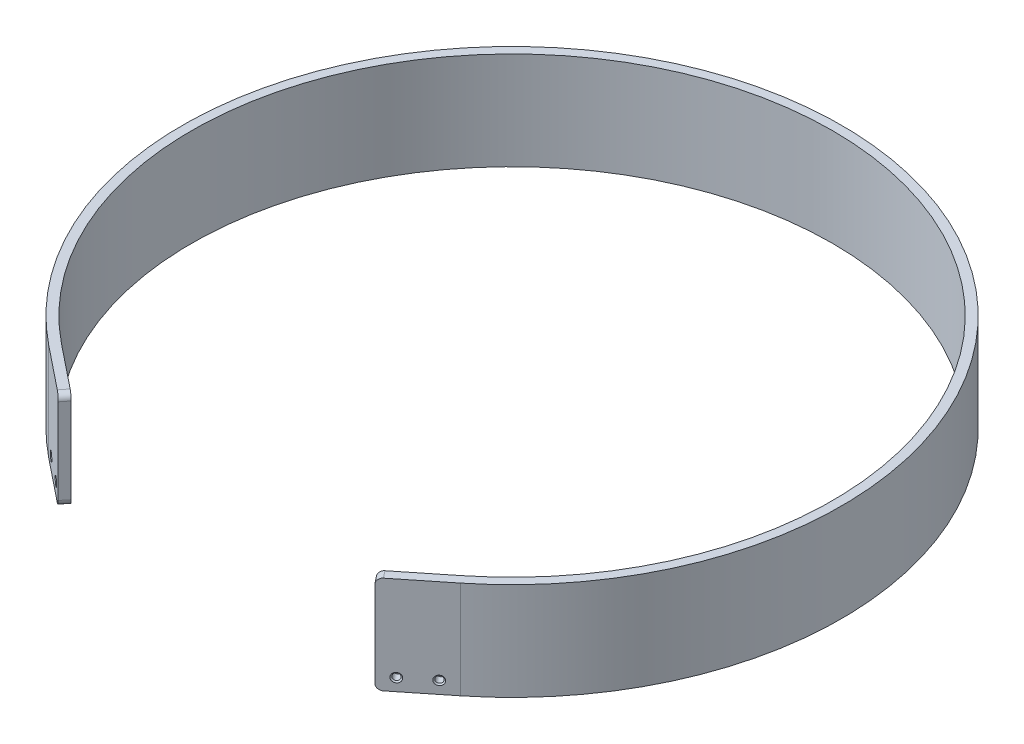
ISO-10303-21;
HEADER;
FILE_DESCRIPTION(('STEP AP214'),'2;1');
FILE_NAME('part.step','',(''),(''),'','','');
FILE_SCHEMA(('AUTOMOTIVE_DESIGN { 1 0 10303 214 1 1 1 1 }'));
ENDSEC;
DATA;
#1=APPLICATION_CONTEXT('core data for automotive mechanical design processes');
#2=APPLICATION_PROTOCOL_DEFINITION('international standard','automotive_design',2000,#1);
#3=PRODUCT_CONTEXT('',#1,'mechanical');
#4=PRODUCT('Part','Part','',(#3));
#5=PRODUCT_RELATED_PRODUCT_CATEGORY('part','',(#4));
#6=PRODUCT_DEFINITION_FORMATION('','',#4);
#7=PRODUCT_DEFINITION_CONTEXT('part definition',#1,'design');
#8=PRODUCT_DEFINITION('design','',#6,#7);
#9=PRODUCT_DEFINITION_SHAPE('','',#8);
#10=(LENGTH_UNIT() NAMED_UNIT(*) SI_UNIT(.MILLI.,.METRE.));
#11=(NAMED_UNIT(*) PLANE_ANGLE_UNIT() SI_UNIT($,.RADIAN.));
#12=(NAMED_UNIT(*) SI_UNIT($,.STERADIAN.) SOLID_ANGLE_UNIT());
#13=UNCERTAINTY_MEASURE_WITH_UNIT(LENGTH_MEASURE(1.E-05),#10,'distance_accuracy_value','');
#14=(GEOMETRIC_REPRESENTATION_CONTEXT(3) GLOBAL_UNCERTAINTY_ASSIGNED_CONTEXT((#13)) GLOBAL_UNIT_ASSIGNED_CONTEXT((#10,
#11,#12)) REPRESENTATION_CONTEXT('',''));
#15=CARTESIAN_POINT('',(0.,0.,0.));
#16=DIRECTION('',(0.,0.,1.));
#17=DIRECTION('',(1.,0.,0.));
#18=AXIS2_PLACEMENT_3D('',#15,#16,#17);
#19=CARTESIAN_POINT('',(104.16246233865,25.4,130.134177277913));
#20=DIRECTION('',(0.624896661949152,0.,0.780707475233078));
#21=DIRECTION('',(0.780707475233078,0.,-0.624896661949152));
#22=AXIS2_PLACEMENT_3D('',#19,#20,#21);
#23=PLANE('',#22);
#24=CARTESIAN_POINT('',(85.5718655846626,-19.05,145.014529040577));
#25=DIRECTION('',(0.624896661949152,0.,0.780707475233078));
#26=DIRECTION('',(0.780707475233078,0.,-0.624896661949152));
#27=AXIS2_PLACEMENT_3D('',#24,#25,#26);
#28=CIRCLE('',#27,1.72719999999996);
#29=CARTESIAN_POINT('',(86.9203035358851,-19.05,143.935207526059));
#30=VERTEX_POINT('',#29);
#31=EDGE_CURVE('E262',#30,#30,#28,.T.);
#32=ORIENTED_EDGE('',*,*,#31,.T.);
#33=EDGE_LOOP('',(#32));
#34=FACE_BOUND('',#33,.T.);
#35=CARTESIAN_POINT('',(97.9655967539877,-19.05,135.094294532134));
#36=DIRECTION('',(0.624896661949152,0.,0.780707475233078));
#37=DIRECTION('',(0.780707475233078,0.,-0.624896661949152));
#38=AXIS2_PLACEMENT_3D('',#35,#36,#37);
#39=CIRCLE('',#38,1.72719999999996);
#40=CARTESIAN_POINT('',(99.3140347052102,-19.05,134.014973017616));
#41=VERTEX_POINT('',#40);
#42=EDGE_CURVE('E159',#41,#41,#39,.T.);
#43=ORIENTED_EDGE('',*,*,#42,.T.);
#44=EDGE_LOOP('',(#43));
#45=FACE_BOUND('',#44,.T.);
#46=DIRECTION('',(-0.780707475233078,0.,0.624896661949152));
#47=VECTOR('',#46,1.);
#48=CARTESIAN_POINT('',(104.16246233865,-25.4,130.134177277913));
#49=LINE('',#48,#47);
#50=CARTESIAN_POINT('',(104.16246233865,-25.4,130.134177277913));
#51=VERTEX_POINT('',#50);
#52=CARTESIAN_POINT('',(81.853746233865,-25.4,147.99059939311));
#53=VERTEX_POINT('',#52);
#54=EDGE_CURVE('E156',#51,#53,#49,.T.);
#55=ORIENTED_EDGE('',*,*,#54,.T.);
#56=CARTESIAN_POINT('',(81.853746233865,-22.225,147.99059939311));
#57=DIRECTION('',(0.624896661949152,0.,0.780707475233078));
#58=DIRECTION('',(0.780707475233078,0.,-0.624896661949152));
#59=AXIS2_PLACEMENT_3D('',#56,#57,#58);
#60=CIRCLE('',#59,3.175);
#61=CARTESIAN_POINT('',(79.375,-22.225,149.974646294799));
#62=VERTEX_POINT('',#61);
#63=EDGE_CURVE('E208',#53,#62,#60,.F.);
#64=ORIENTED_EDGE('',*,*,#63,.T.);
#65=DIRECTION('',(0.,-1.,0.));
#66=VECTOR('',#65,1.);
#67=CARTESIAN_POINT('',(79.375,25.4,149.974646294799));
#68=LINE('',#67,#66);
#69=CARTESIAN_POINT('',(79.375,22.225,149.974646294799));
#70=VERTEX_POINT('',#69);
#71=EDGE_CURVE('E182',#70,#62,#68,.T.);
#72=ORIENTED_EDGE('',*,*,#71,.F.);
#73=CARTESIAN_POINT('',(81.853746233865,22.225,147.99059939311));
#74=DIRECTION('',(0.624896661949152,0.,0.780707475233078));
#75=DIRECTION('',(0.780707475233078,0.,-0.624896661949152));
#76=AXIS2_PLACEMENT_3D('',#73,#74,#75);
#77=CIRCLE('',#76,3.175);
#78=CARTESIAN_POINT('',(81.853746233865,25.4,147.99059939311));
#79=VERTEX_POINT('',#78);
#80=EDGE_CURVE('E206',#70,#79,#77,.F.);
#81=ORIENTED_EDGE('',*,*,#80,.T.);
#82=DIRECTION('',(-0.780707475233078,0.,0.624896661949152));
#83=VECTOR('',#82,1.);
#84=CARTESIAN_POINT('',(104.16246233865,25.4,130.134177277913));
#85=LINE('',#84,#83);
#86=CARTESIAN_POINT('',(104.16246233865,25.4,130.134177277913));
#87=VERTEX_POINT('',#86);
#88=EDGE_CURVE('E141',#87,#79,#85,.T.);
#89=ORIENTED_EDGE('',*,*,#88,.F.);
#90=DIRECTION('',(0.,-1.,0.));
#91=VECTOR('',#90,1.);
#92=CARTESIAN_POINT('',(104.16246233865,25.4,130.134177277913));
#93=LINE('',#92,#91);
#94=EDGE_CURVE('E155',#87,#51,#93,.T.);
#95=ORIENTED_EDGE('',*,*,#94,.T.);
#96=EDGE_LOOP('',(#55,#64,#72,#81,#89,#95));
#97=FACE_BOUND('',#96,.T.);
#98=ADVANCED_FACE('F33',(#34,#45,#97),#23,.F.);
#99=CARTESIAN_POINT('',(82.3510703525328,25.4,153.692765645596));
#100=DIRECTION('',(-0.780707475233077,0.,0.624896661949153));
#101=DIRECTION('',(0.624896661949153,0.,0.780707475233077));
#102=AXIS2_PLACEMENT_3D('',#99,#100,#101);
#103=PLANE('',#102);
#104=ORIENTED_EDGE('',*,*,#71,.T.);
#105=DIRECTION('',(-0.624896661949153,0.,-0.780707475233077));
#106=VECTOR('',#105,1.);
#107=CARTESIAN_POINT('',(82.3510703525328,-22.225,153.692765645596));
#108=LINE('',#107,#106);
#109=CARTESIAN_POINT('',(82.3510703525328,-22.225,153.692765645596));
#110=VERTEX_POINT('',#109);
#111=EDGE_CURVE('E48',#62,#110,#108,.F.);
#112=ORIENTED_EDGE('',*,*,#111,.T.);
#113=DIRECTION('',(0.,-1.,0.));
#114=VECTOR('',#113,1.);
#115=CARTESIAN_POINT('',(82.3510703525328,25.4,153.692765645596));
#116=LINE('',#115,#114);
#117=CARTESIAN_POINT('',(82.3510703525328,22.225,153.692765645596));
#118=VERTEX_POINT('',#117);
#119=EDGE_CURVE('E130',#118,#110,#116,.T.);
#120=ORIENTED_EDGE('',*,*,#119,.F.);
#121=DIRECTION('',(-0.624896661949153,0.,-0.780707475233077));
#122=VECTOR('',#121,1.);
#123=CARTESIAN_POINT('',(82.3510703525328,22.225,153.692765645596));
#124=LINE('',#123,#122);
#125=EDGE_CURVE('E210',#118,#70,#124,.T.);
#126=ORIENTED_EDGE('',*,*,#125,.T.);
#127=EDGE_LOOP('',(#104,#112,#120,#126));
#128=FACE_BOUND('',#127,.T.);
#129=ADVANCED_FACE('F215',(#128),#103,.T.);
#130=CARTESIAN_POINT('',(107.138532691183,25.4,133.85229662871));
#131=DIRECTION('',(0.624896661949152,0.,0.780707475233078));
#132=DIRECTION('',(0.780707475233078,0.,-0.624896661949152));
#133=AXIS2_PLACEMENT_3D('',#130,#131,#132);
#134=PLANE('',#133);
#135=CARTESIAN_POINT('',(88.5479359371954,-19.05,148.732648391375));
#136=DIRECTION('',(0.624896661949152,0.,0.780707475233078));
#137=DIRECTION('',(0.780707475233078,0.,-0.624896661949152));
#138=AXIS2_PLACEMENT_3D('',#135,#136,#137);
#139=CIRCLE('',#138,2.3622);
#140=CARTESIAN_POINT('',(90.392123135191,-19.05,147.256517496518));
#141=VERTEX_POINT('',#140);
#142=EDGE_CURVE('E268',#141,#141,#139,.T.);
#143=ORIENTED_EDGE('',*,*,#142,.F.);
#144=EDGE_LOOP('',(#143));
#145=FACE_BOUND('',#144,.T.);
#146=CARTESIAN_POINT('',(100.941667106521,-19.05,138.812413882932));
#147=DIRECTION('',(0.624896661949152,0.,0.780707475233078));
#148=DIRECTION('',(0.780707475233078,0.,-0.624896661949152));
#149=AXIS2_PLACEMENT_3D('',#146,#147,#148);
#150=CIRCLE('',#149,2.3622);
#151=CARTESIAN_POINT('',(102.785854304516,-19.05,137.336282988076));
#152=VERTEX_POINT('',#151);
#153=EDGE_CURVE('E259',#152,#152,#150,.T.);
#154=ORIENTED_EDGE('',*,*,#153,.F.);
#155=EDGE_LOOP('',(#154));
#156=FACE_BOUND('',#155,.T.);
#157=ORIENTED_EDGE('',*,*,#119,.T.);
#158=CARTESIAN_POINT('',(84.8298165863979,-22.225,151.708718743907));
#159=DIRECTION('',(0.624896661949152,0.,0.780707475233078));
#160=DIRECTION('',(0.780707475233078,0.,-0.624896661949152));
#161=AXIS2_PLACEMENT_3D('',#158,#159,#160);
#162=CIRCLE('',#161,3.175);
#163=CARTESIAN_POINT('',(84.8298165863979,-25.4,151.708718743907));
#164=VERTEX_POINT('',#163);
#165=EDGE_CURVE('E11',#110,#164,#162,.T.);
#166=ORIENTED_EDGE('',*,*,#165,.T.);
#167=DIRECTION('',(-0.780707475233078,0.,0.624896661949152));
#168=VECTOR('',#167,1.);
#169=CARTESIAN_POINT('',(107.138532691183,-25.4,133.85229662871));
#170=LINE('',#169,#168);
#171=CARTESIAN_POINT('',(107.138532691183,-25.4,133.85229662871));
#172=VERTEX_POINT('',#171);
#173=EDGE_CURVE('E125',#172,#164,#170,.T.);
#174=ORIENTED_EDGE('',*,*,#173,.F.);
#175=DIRECTION('',(0.,-1.,0.));
#176=VECTOR('',#175,1.);
#177=CARTESIAN_POINT('',(107.138532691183,25.4,133.85229662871));
#178=LINE('',#177,#176);
#179=CARTESIAN_POINT('',(107.138532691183,25.4,133.85229662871));
#180=VERTEX_POINT('',#179);
#181=EDGE_CURVE('E120',#180,#172,#178,.T.);
#182=ORIENTED_EDGE('',*,*,#181,.F.);
#183=DIRECTION('',(-0.780707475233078,0.,0.624896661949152));
#184=VECTOR('',#183,1.);
#185=CARTESIAN_POINT('',(107.138532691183,25.4,133.85229662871));
#186=LINE('',#185,#184);
#187=CARTESIAN_POINT('',(84.8298165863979,25.4,151.708718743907));
#188=VERTEX_POINT('',#187);
#189=EDGE_CURVE('E123',#180,#188,#186,.T.);
#190=ORIENTED_EDGE('',*,*,#189,.T.);
#191=CARTESIAN_POINT('',(84.8298165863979,22.225,151.708718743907));
#192=DIRECTION('',(0.624896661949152,0.,0.780707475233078));
#193=DIRECTION('',(0.780707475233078,0.,-0.624896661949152));
#194=AXIS2_PLACEMENT_3D('',#191,#192,#193);
#195=CIRCLE('',#194,3.175);
#196=EDGE_CURVE('E41',#188,#118,#195,.T.);
#197=ORIENTED_EDGE('',*,*,#196,.T.);
#198=EDGE_LOOP('',(#157,#166,#174,#182,#190,#197));
#199=FACE_BOUND('',#198,.T.);
#200=ADVANCED_FACE('F122',(#145,#156,#199),#134,.T.);
#201=CARTESIAN_POINT('',(0.,25.4,0.));
#202=DIRECTION('',(0.,-1.,0.));
#203=DIRECTION('',(0.,0.,-1.));
#204=AXIS2_PLACEMENT_3D('',#201,#202,#203);
#205=CYLINDRICAL_SURFACE('',#204,171.45);
#206=CARTESIAN_POINT('',(0.,-25.4,0.));
#207=DIRECTION('',(0.,1.,0.));
#208=DIRECTION('',(1.,0.,0.));
#209=AXIS2_PLACEMENT_3D('',#206,#207,#208);
#210=CIRCLE('',#209,171.45);
#211=CARTESIAN_POINT('',(-107.138532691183,-25.4,133.85229662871));
#212=VERTEX_POINT('',#211);
#213=EDGE_CURVE('E161',#212,#172,#210,.F.);
#214=ORIENTED_EDGE('',*,*,#213,.F.);
#215=DIRECTION('',(0.,-1.,0.));
#216=VECTOR('',#215,1.);
#217=CARTESIAN_POINT('',(-107.138532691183,25.4,133.85229662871));
#218=LINE('',#217,#216);
#219=CARTESIAN_POINT('',(-107.138532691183,25.4,133.85229662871));
#220=VERTEX_POINT('',#219);
#221=EDGE_CURVE('E131',#220,#212,#218,.T.);
#222=ORIENTED_EDGE('',*,*,#221,.F.);
#223=CARTESIAN_POINT('',(0.,25.4,0.));
#224=DIRECTION('',(0.,1.,0.));
#225=DIRECTION('',(1.,0.,0.));
#226=AXIS2_PLACEMENT_3D('',#223,#224,#225);
#227=CIRCLE('',#226,171.45);
#228=EDGE_CURVE('E137',#220,#180,#227,.F.);
#229=ORIENTED_EDGE('',*,*,#228,.T.);
#230=ORIENTED_EDGE('',*,*,#181,.T.);
#231=EDGE_LOOP('',(#214,#222,#229,#230));
#232=FACE_BOUND('',#231,.T.);
#233=ADVANCED_FACE('F144',(#232),#205,.T.);
#234=CARTESIAN_POINT('',(-107.138532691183,25.4,133.85229662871));
#235=DIRECTION('',(-0.624896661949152,0.,0.780707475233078));
#236=DIRECTION('',(0.780707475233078,0.,0.624896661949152));
#237=AXIS2_PLACEMENT_3D('',#234,#235,#236);
#238=PLANE('',#237);
#239=CARTESIAN_POINT('',(-88.5479359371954,-19.05,148.732648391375));
#240=DIRECTION('',(-0.624896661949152,0.,0.780707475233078));
#241=DIRECTION('',(0.780707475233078,0.,0.624896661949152));
#242=AXIS2_PLACEMENT_3D('',#239,#240,#241);
#243=CIRCLE('',#242,2.3622);
#244=CARTESIAN_POINT('',(-86.7037487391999,-19.05,150.208779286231));
#245=VERTEX_POINT('',#244);
#246=EDGE_CURVE('E286',#245,#245,#243,.T.);
#247=ORIENTED_EDGE('',*,*,#246,.F.);
#248=EDGE_LOOP('',(#247));
#249=FACE_BOUND('',#248,.T.);
#250=CARTESIAN_POINT('',(-100.941667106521,-19.05,138.812413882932));
#251=DIRECTION('',(-0.624896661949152,0.,0.780707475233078));
#252=DIRECTION('',(0.780707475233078,0.,0.624896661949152));
#253=AXIS2_PLACEMENT_3D('',#250,#251,#252);
#254=CIRCLE('',#253,2.3622);
#255=CARTESIAN_POINT('',(-99.0974799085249,-19.05,140.288544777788));
#256=VERTEX_POINT('',#255);
#257=EDGE_CURVE('E277',#256,#256,#254,.T.);
#258=ORIENTED_EDGE('',*,*,#257,.F.);
#259=EDGE_LOOP('',(#258));
#260=FACE_BOUND('',#259,.T.);
#261=DIRECTION('',(-0.780707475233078,0.,-0.624896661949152));
#262=VECTOR('',#261,1.);
#263=CARTESIAN_POINT('',(-107.138532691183,-25.4,133.85229662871));
#264=LINE('',#263,#262);
#265=CARTESIAN_POINT('',(-84.8298165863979,-25.4,151.708718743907));
#266=VERTEX_POINT('',#265);
#267=EDGE_CURVE('E163',#266,#212,#264,.T.);
#268=ORIENTED_EDGE('',*,*,#267,.F.);
#269=CARTESIAN_POINT('',(-84.8298165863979,-22.225,151.708718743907));
#270=DIRECTION('',(-0.624896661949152,0.,0.780707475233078));
#271=DIRECTION('',(0.780707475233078,0.,0.624896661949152));
#272=AXIS2_PLACEMENT_3D('',#269,#270,#271);
#273=CIRCLE('',#272,3.175);
#274=CARTESIAN_POINT('',(-82.3510703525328,-22.225,153.692765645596));
#275=VERTEX_POINT('',#274);
#276=EDGE_CURVE('E192',#266,#275,#273,.T.);
#277=ORIENTED_EDGE('',*,*,#276,.T.);
#278=DIRECTION('',(0.,-1.,0.));
#279=VECTOR('',#278,1.);
#280=CARTESIAN_POINT('',(-82.3510703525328,25.4,153.692765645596));
#281=LINE('',#280,#279);
#282=CARTESIAN_POINT('',(-82.3510703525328,22.225,153.692765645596));
#283=VERTEX_POINT('',#282);
#284=EDGE_CURVE('E177',#283,#275,#281,.T.);
#285=ORIENTED_EDGE('',*,*,#284,.F.);
#286=CARTESIAN_POINT('',(-84.8298165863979,22.225,151.708718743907));
#287=DIRECTION('',(-0.624896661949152,0.,0.780707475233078));
#288=DIRECTION('',(0.780707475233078,0.,0.624896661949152));
#289=AXIS2_PLACEMENT_3D('',#286,#287,#288);
#290=CIRCLE('',#289,3.175);
#291=CARTESIAN_POINT('',(-84.8298165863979,25.4,151.708718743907));
#292=VERTEX_POINT('',#291);
#293=EDGE_CURVE('E190',#283,#292,#290,.T.);
#294=ORIENTED_EDGE('',*,*,#293,.T.);
#295=DIRECTION('',(-0.780707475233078,0.,-0.624896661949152));
#296=VECTOR('',#295,1.);
#297=CARTESIAN_POINT('',(-107.138532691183,25.4,133.85229662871));
#298=LINE('',#297,#296);
#299=EDGE_CURVE('E146',#292,#220,#298,.T.);
#300=ORIENTED_EDGE('',*,*,#299,.T.);
#301=ORIENTED_EDGE('',*,*,#221,.T.);
#302=EDGE_LOOP('',(#268,#277,#285,#294,#300,#301));
#303=FACE_BOUND('',#302,.T.);
#304=ADVANCED_FACE('F231',(#249,#260,#303),#238,.T.);
#305=CARTESIAN_POINT('',(-79.375,25.4,149.974646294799));
#306=DIRECTION('',(0.780707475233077,0.,0.624896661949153));
#307=DIRECTION('',(0.624896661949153,0.,-0.780707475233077));
#308=AXIS2_PLACEMENT_3D('',#305,#306,#307);
#309=PLANE('',#308);
#310=ORIENTED_EDGE('',*,*,#284,.T.);
#311=DIRECTION('',(-0.624896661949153,0.,0.780707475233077));
#312=VECTOR('',#311,1.);
#313=CARTESIAN_POINT('',(-79.375,-22.225,149.974646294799));
#314=LINE('',#313,#312);
#315=CARTESIAN_POINT('',(-79.375,-22.225,149.974646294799));
#316=VERTEX_POINT('',#315);
#317=EDGE_CURVE('E197',#275,#316,#314,.F.);
#318=ORIENTED_EDGE('',*,*,#317,.T.);
#319=DIRECTION('',(0.,-1.,0.));
#320=VECTOR('',#319,1.);
#321=CARTESIAN_POINT('',(-79.375,25.4,149.974646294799));
#322=LINE('',#321,#320);
#323=CARTESIAN_POINT('',(-79.375,22.225,149.974646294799));
#324=VERTEX_POINT('',#323);
#325=EDGE_CURVE('E174',#324,#316,#322,.T.);
#326=ORIENTED_EDGE('',*,*,#325,.F.);
#327=DIRECTION('',(-0.624896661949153,0.,0.780707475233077));
#328=VECTOR('',#327,1.);
#329=CARTESIAN_POINT('',(-79.375,22.225,149.974646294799));
#330=LINE('',#329,#328);
#331=EDGE_CURVE('E194',#324,#283,#330,.T.);
#332=ORIENTED_EDGE('',*,*,#331,.T.);
#333=EDGE_LOOP('',(#310,#318,#326,#332));
#334=FACE_BOUND('',#333,.T.);
#335=ADVANCED_FACE('F245',(#334),#309,.T.);
#336=CARTESIAN_POINT('',(-104.16246233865,25.4,130.134177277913));
#337=DIRECTION('',(-0.624896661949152,0.,0.780707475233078));
#338=DIRECTION('',(0.780707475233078,0.,0.624896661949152));
#339=AXIS2_PLACEMENT_3D('',#336,#337,#338);
#340=PLANE('',#339);
#341=CARTESIAN_POINT('',(-85.5718655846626,-19.05,145.014529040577));
#342=DIRECTION('',(-0.624896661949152,0.,0.780707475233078));
#343=DIRECTION('',(0.780707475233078,0.,0.624896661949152));
#344=AXIS2_PLACEMENT_3D('',#341,#342,#343);
#345=CIRCLE('',#344,1.72719999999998);
#346=CARTESIAN_POINT('',(-84.22342763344,-19.05,146.093850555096));
#347=VERTEX_POINT('',#346);
#348=EDGE_CURVE('E280',#347,#347,#345,.T.);
#349=ORIENTED_EDGE('',*,*,#348,.T.);
#350=EDGE_LOOP('',(#349));
#351=FACE_BOUND('',#350,.T.);
#352=CARTESIAN_POINT('',(-97.9655967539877,-19.05,135.094294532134));
#353=DIRECTION('',(-0.624896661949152,0.,0.780707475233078));
#354=DIRECTION('',(0.780707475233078,0.,0.624896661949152));
#355=AXIS2_PLACEMENT_3D('',#352,#353,#354);
#356=CIRCLE('',#355,1.72719999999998);
#357=CARTESIAN_POINT('',(-96.6171588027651,-19.05,136.173616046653));
#358=VERTEX_POINT('',#357);
#359=EDGE_CURVE('E271',#358,#358,#356,.T.);
#360=ORIENTED_EDGE('',*,*,#359,.T.);
#361=EDGE_LOOP('',(#360));
#362=FACE_BOUND('',#361,.T.);
#363=ORIENTED_EDGE('',*,*,#325,.T.);
#364=CARTESIAN_POINT('',(-81.853746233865,-22.225,147.99059939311));
#365=DIRECTION('',(-0.624896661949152,0.,0.780707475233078));
#366=DIRECTION('',(0.780707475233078,0.,0.624896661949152));
#367=AXIS2_PLACEMENT_3D('',#364,#365,#366);
#368=CIRCLE('',#367,3.175);
#369=CARTESIAN_POINT('',(-81.853746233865,-25.4,147.99059939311));
#370=VERTEX_POINT('',#369);
#371=EDGE_CURVE('E201',#316,#370,#368,.F.);
#372=ORIENTED_EDGE('',*,*,#371,.T.);
#373=DIRECTION('',(-0.780707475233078,0.,-0.624896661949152));
#374=VECTOR('',#373,1.);
#375=CARTESIAN_POINT('',(-104.16246233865,-25.4,130.134177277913));
#376=LINE('',#375,#374);
#377=CARTESIAN_POINT('',(-104.16246233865,-25.4,130.134177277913));
#378=VERTEX_POINT('',#377);
#379=EDGE_CURVE('E165',#370,#378,#376,.T.);
#380=ORIENTED_EDGE('',*,*,#379,.T.);
#381=DIRECTION('',(0.,-1.,0.));
#382=VECTOR('',#381,1.);
#383=CARTESIAN_POINT('',(-104.16246233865,25.4,130.134177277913));
#384=LINE('',#383,#382);
#385=CARTESIAN_POINT('',(-104.16246233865,25.4,130.134177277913));
#386=VERTEX_POINT('',#385);
#387=EDGE_CURVE('E171',#386,#378,#384,.T.);
#388=ORIENTED_EDGE('',*,*,#387,.F.);
#389=DIRECTION('',(-0.780707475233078,0.,-0.624896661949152));
#390=VECTOR('',#389,1.);
#391=CARTESIAN_POINT('',(-104.16246233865,25.4,130.134177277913));
#392=LINE('',#391,#390);
#393=CARTESIAN_POINT('',(-81.853746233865,25.4,147.99059939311));
#394=VERTEX_POINT('',#393);
#395=EDGE_CURVE('E148',#394,#386,#392,.T.);
#396=ORIENTED_EDGE('',*,*,#395,.F.);
#397=CARTESIAN_POINT('',(-81.853746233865,22.225,147.99059939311));
#398=DIRECTION('',(-0.624896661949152,0.,0.780707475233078));
#399=DIRECTION('',(0.780707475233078,0.,0.624896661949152));
#400=AXIS2_PLACEMENT_3D('',#397,#398,#399);
#401=CIRCLE('',#400,3.175);
#402=EDGE_CURVE('E199',#394,#324,#401,.F.);
#403=ORIENTED_EDGE('',*,*,#402,.T.);
#404=EDGE_LOOP('',(#363,#372,#380,#388,#396,#403));
#405=FACE_BOUND('',#404,.T.);
#406=ADVANCED_FACE('F241',(#351,#362,#405),#340,.F.);
#407=CARTESIAN_POINT('',(0.,25.4,0.));
#408=DIRECTION('',(0.,-1.,0.));
#409=DIRECTION('',(0.,0.,-1.));
#410=AXIS2_PLACEMENT_3D('',#407,#408,#409);
#411=CYLINDRICAL_SURFACE('',#410,166.6875);
#412=CARTESIAN_POINT('',(0.,-25.4,0.));
#413=DIRECTION('',(0.,-1.,0.));
#414=DIRECTION('',(0.,0.,-1.));
#415=AXIS2_PLACEMENT_3D('',#412,#413,#414);
#416=CIRCLE('',#415,166.6875);
#417=EDGE_CURVE('E167',#378,#51,#416,.T.);
#418=ORIENTED_EDGE('',*,*,#417,.T.);
#419=ORIENTED_EDGE('',*,*,#94,.F.);
#420=CARTESIAN_POINT('',(0.,25.4,0.));
#421=DIRECTION('',(0.,-1.,0.));
#422=DIRECTION('',(0.,0.,-1.));
#423=AXIS2_PLACEMENT_3D('',#420,#421,#422);
#424=CIRCLE('',#423,166.6875);
#425=EDGE_CURVE('E153',#386,#87,#424,.T.);
#426=ORIENTED_EDGE('',*,*,#425,.F.);
#427=ORIENTED_EDGE('',*,*,#387,.T.);
#428=EDGE_LOOP('',(#418,#419,#426,#427));
#429=FACE_BOUND('',#428,.T.);
#430=ADVANCED_FACE('F251',(#429),#411,.F.);
#431=CARTESIAN_POINT('',(0.,25.4,0.));
#432=DIRECTION('',(0.,1.,0.));
#433=DIRECTION('',(1.,0.,0.));
#434=AXIS2_PLACEMENT_3D('',#431,#432,#433);
#435=PLANE('',#434);
#436=ORIENTED_EDGE('',*,*,#299,.F.);
#437=DIRECTION('',(-0.624896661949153,0.,0.780707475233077));
#438=VECTOR('',#437,1.);
#439=CARTESIAN_POINT('',(22.3087161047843,25.4,17.8564221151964));
#440=LINE('',#439,#438);
#441=EDGE_CURVE('E204',#292,#394,#440,.F.);
#442=ORIENTED_EDGE('',*,*,#441,.T.);
#443=ORIENTED_EDGE('',*,*,#395,.T.);
#444=ORIENTED_EDGE('',*,*,#425,.T.);
#445=ORIENTED_EDGE('',*,*,#88,.T.);
#446=DIRECTION('',(-0.624896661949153,0.,-0.780707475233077));
#447=VECTOR('',#446,1.);
#448=CARTESIAN_POINT('',(-22.3087161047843,25.4,17.8564221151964));
#449=LINE('',#448,#447);
#450=EDGE_CURVE('E140',#79,#188,#449,.F.);
#451=ORIENTED_EDGE('',*,*,#450,.T.);
#452=ORIENTED_EDGE('',*,*,#189,.F.);
#453=ORIENTED_EDGE('',*,*,#228,.F.);
#454=EDGE_LOOP('',(#436,#442,#443,#444,#445,#451,#452,#453));
#455=FACE_BOUND('',#454,.T.);
#456=ADVANCED_FACE('F136',(#455),#435,.T.);
#457=CARTESIAN_POINT('',(0.,-25.4,0.));
#458=DIRECTION('',(0.,1.,0.));
#459=DIRECTION('',(1.,0.,0.));
#460=AXIS2_PLACEMENT_3D('',#457,#458,#459);
#461=PLANE('',#460);
#462=ORIENTED_EDGE('',*,*,#379,.F.);
#463=DIRECTION('',(-0.624896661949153,0.,0.780707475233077));
#464=VECTOR('',#463,1.);
#465=CARTESIAN_POINT('',(-84.8298165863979,-25.4,151.708718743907));
#466=LINE('',#465,#464);
#467=EDGE_CURVE('E187',#370,#266,#466,.T.);
#468=ORIENTED_EDGE('',*,*,#467,.T.);
#469=ORIENTED_EDGE('',*,*,#267,.T.);
#470=ORIENTED_EDGE('',*,*,#213,.T.);
#471=ORIENTED_EDGE('',*,*,#173,.T.);
#472=DIRECTION('',(-0.624896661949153,0.,-0.780707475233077));
#473=VECTOR('',#472,1.);
#474=CARTESIAN_POINT('',(81.853746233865,-25.4,147.99059939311));
#475=LINE('',#474,#473);
#476=EDGE_CURVE('E184',#164,#53,#475,.T.);
#477=ORIENTED_EDGE('',*,*,#476,.T.);
#478=ORIENTED_EDGE('',*,*,#54,.F.);
#479=ORIENTED_EDGE('',*,*,#417,.F.);
#480=EDGE_LOOP('',(#462,#468,#469,#470,#471,#477,#478,#479));
#481=FACE_BOUND('',#480,.T.);
#482=ADVANCED_FACE('F226',(#481),#461,.F.);
#483=CARTESIAN_POINT('',(100.941667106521,-19.05,138.812413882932));
#484=DIRECTION('',(0.624896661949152,0.,0.780707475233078));
#485=DIRECTION('',(0.780707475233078,0.,-0.624896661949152));
#486=AXIS2_PLACEMENT_3D('',#483,#484,#485);
#487=CYLINDRICAL_SURFACE('',#486,1.72719999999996);
#488=ORIENTED_EDGE('',*,*,#42,.F.);
#489=EDGE_LOOP('',(#488));
#490=FACE_BOUND('',#489,.T.);
#491=CARTESIAN_POINT('',(100.544857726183,-19.05,138.316664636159));
#492=DIRECTION('',(0.624896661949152,0.,0.780707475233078));
#493=DIRECTION('',(0.780707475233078,0.,-0.624896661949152));
#494=AXIS2_PLACEMENT_3D('',#491,#492,#493);
#495=CIRCLE('',#494,1.72719999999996);
#496=CARTESIAN_POINT('',(101.893295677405,-19.05,137.23734312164));
#497=VERTEX_POINT('',#496);
#498=EDGE_CURVE('E256',#497,#497,#495,.T.);
#499=ORIENTED_EDGE('',*,*,#498,.T.);
#500=EDGE_LOOP('',(#499));
#501=FACE_BOUND('',#500,.T.);
#502=ADVANCED_FACE('F408',(#490,#501),#487,.F.);
#503=CARTESIAN_POINT('',(100.941667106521,-19.05,138.812413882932));
#504=DIRECTION('',(0.624896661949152,0.,0.780707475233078));
#505=DIRECTION('',(0.780707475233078,0.,-0.624896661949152));
#506=AXIS2_PLACEMENT_3D('',#503,#504,#505);
#507=CONICAL_SURFACE('',#506,2.3622,0.78539816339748);
#508=ORIENTED_EDGE('',*,*,#498,.F.);
#509=EDGE_LOOP('',(#508));
#510=FACE_BOUND('',#509,.T.);
#511=ORIENTED_EDGE('',*,*,#153,.T.);
#512=EDGE_LOOP('',(#511));
#513=FACE_BOUND('',#512,.T.);
#514=ADVANCED_FACE('F444',(#510,#513),#507,.F.);
#515=CARTESIAN_POINT('',(88.5479359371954,-19.05,148.732648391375));
#516=DIRECTION('',(0.624896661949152,0.,0.780707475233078));
#517=DIRECTION('',(0.780707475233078,0.,-0.624896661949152));
#518=AXIS2_PLACEMENT_3D('',#515,#516,#517);
#519=CYLINDRICAL_SURFACE('',#518,1.72719999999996);
#520=ORIENTED_EDGE('',*,*,#31,.F.);
#521=EDGE_LOOP('',(#520));
#522=FACE_BOUND('',#521,.T.);
#523=CARTESIAN_POINT('',(88.1511265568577,-19.05,148.236899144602));
#524=DIRECTION('',(0.624896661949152,0.,0.780707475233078));
#525=DIRECTION('',(0.780707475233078,0.,-0.624896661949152));
#526=AXIS2_PLACEMENT_3D('',#523,#524,#525);
#527=CIRCLE('',#526,1.72719999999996);
#528=CARTESIAN_POINT('',(89.4995645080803,-19.05,147.157577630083));
#529=VERTEX_POINT('',#528);
#530=EDGE_CURVE('E265',#529,#529,#527,.T.);
#531=ORIENTED_EDGE('',*,*,#530,.T.);
#532=EDGE_LOOP('',(#531));
#533=FACE_BOUND('',#532,.T.);
#534=ADVANCED_FACE('F437',(#522,#533),#519,.F.);
#535=CARTESIAN_POINT('',(88.5479359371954,-19.05,148.732648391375));
#536=DIRECTION('',(0.624896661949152,0.,0.780707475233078));
#537=DIRECTION('',(0.780707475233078,0.,-0.624896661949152));
#538=AXIS2_PLACEMENT_3D('',#535,#536,#537);
#539=CONICAL_SURFACE('',#538,2.3622,0.78539816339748);
#540=ORIENTED_EDGE('',*,*,#530,.F.);
#541=EDGE_LOOP('',(#540));
#542=FACE_BOUND('',#541,.T.);
#543=ORIENTED_EDGE('',*,*,#142,.T.);
#544=EDGE_LOOP('',(#543));
#545=FACE_BOUND('',#544,.T.);
#546=ADVANCED_FACE('F324',(#542,#545),#539,.F.);
#547=CARTESIAN_POINT('',(22.3087161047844,-22.225,17.8564221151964));
#548=DIRECTION('',(0.624896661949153,0.,-0.780707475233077));
#549=DIRECTION('',(-0.780707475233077,0.,-0.624896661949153));
#550=AXIS2_PLACEMENT_3D('',#547,#548,#549);
#551=CYLINDRICAL_SURFACE('',#550,3.175);
#552=ORIENTED_EDGE('',*,*,#371,.F.);
#553=ORIENTED_EDGE('',*,*,#317,.F.);
#554=ORIENTED_EDGE('',*,*,#276,.F.);
#555=ORIENTED_EDGE('',*,*,#467,.F.);
#556=EDGE_LOOP('',(#552,#553,#554,#555));
#557=FACE_BOUND('',#556,.T.);
#558=ADVANCED_FACE('F248',(#557),#551,.T.);
#559=CARTESIAN_POINT('',(-81.853746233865,22.225,147.99059939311));
#560=DIRECTION('',(-0.624896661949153,0.,0.780707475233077));
#561=DIRECTION('',(0.780707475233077,0.,0.624896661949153));
#562=AXIS2_PLACEMENT_3D('',#559,#560,#561);
#563=CYLINDRICAL_SURFACE('',#562,3.175);
#564=ORIENTED_EDGE('',*,*,#402,.F.);
#565=ORIENTED_EDGE('',*,*,#441,.F.);
#566=ORIENTED_EDGE('',*,*,#293,.F.);
#567=ORIENTED_EDGE('',*,*,#331,.F.);
#568=EDGE_LOOP('',(#564,#565,#566,#567));
#569=FACE_BOUND('',#568,.T.);
#570=ADVANCED_FACE('F237',(#569),#563,.T.);
#571=CARTESIAN_POINT('',(-22.3087161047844,-22.225,17.8564221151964));
#572=DIRECTION('',(0.624896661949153,0.,0.780707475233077));
#573=DIRECTION('',(0.780707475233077,0.,-0.624896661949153));
#574=AXIS2_PLACEMENT_3D('',#571,#572,#573);
#575=CYLINDRICAL_SURFACE('',#574,3.175);
#576=ORIENTED_EDGE('',*,*,#165,.F.);
#577=ORIENTED_EDGE('',*,*,#111,.F.);
#578=ORIENTED_EDGE('',*,*,#63,.F.);
#579=ORIENTED_EDGE('',*,*,#476,.F.);
#580=EDGE_LOOP('',(#576,#577,#578,#579));
#581=FACE_BOUND('',#580,.T.);
#582=ADVANCED_FACE('F223',(#581),#575,.T.);
#583=CARTESIAN_POINT('',(84.8298165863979,22.225,151.708718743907));
#584=DIRECTION('',(-0.624896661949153,0.,-0.780707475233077));
#585=DIRECTION('',(-0.780707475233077,0.,0.624896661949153));
#586=AXIS2_PLACEMENT_3D('',#583,#584,#585);
#587=CYLINDRICAL_SURFACE('',#586,3.175);
#588=ORIENTED_EDGE('',*,*,#196,.F.);
#589=ORIENTED_EDGE('',*,*,#450,.F.);
#590=ORIENTED_EDGE('',*,*,#80,.F.);
#591=ORIENTED_EDGE('',*,*,#125,.F.);
#592=EDGE_LOOP('',(#588,#589,#590,#591));
#593=FACE_BOUND('',#592,.T.);
#594=ADVANCED_FACE('F35',(#593),#587,.T.);
#595=CARTESIAN_POINT('',(-100.941667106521,-19.05,138.812413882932));
#596=DIRECTION('',(-0.624896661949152,0.,0.780707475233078));
#597=DIRECTION('',(0.780707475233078,0.,0.624896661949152));
#598=AXIS2_PLACEMENT_3D('',#595,#596,#597);
#599=CYLINDRICAL_SURFACE('',#598,1.72719999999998);
#600=ORIENTED_EDGE('',*,*,#359,.F.);
#601=EDGE_LOOP('',(#600));
#602=FACE_BOUND('',#601,.T.);
#603=CARTESIAN_POINT('',(-100.544857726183,-19.05,138.316664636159));
#604=DIRECTION('',(-0.624896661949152,0.,0.780707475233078));
#605=DIRECTION('',(0.780707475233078,0.,0.624896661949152));
#606=AXIS2_PLACEMENT_3D('',#603,#604,#605);
#607=CIRCLE('',#606,1.72719999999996);
#608=CARTESIAN_POINT('',(-99.1964197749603,-19.05,139.395986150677));
#609=VERTEX_POINT('',#608);
#610=EDGE_CURVE('E274',#609,#609,#607,.T.);
#611=ORIENTED_EDGE('',*,*,#610,.T.);
#612=EDGE_LOOP('',(#611));
#613=FACE_BOUND('',#612,.T.);
#614=ADVANCED_FACE('F300',(#602,#613),#599,.F.);
#615=CARTESIAN_POINT('',(-100.941667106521,-19.05,138.812413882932));
#616=DIRECTION('',(-0.624896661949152,0.,0.780707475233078));
#617=DIRECTION('',(0.780707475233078,0.,0.624896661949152));
#618=AXIS2_PLACEMENT_3D('',#615,#616,#617);
#619=CONICAL_SURFACE('',#618,2.3622,0.78539816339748);
#620=ORIENTED_EDGE('',*,*,#610,.F.);
#621=EDGE_LOOP('',(#620));
#622=FACE_BOUND('',#621,.T.);
#623=ORIENTED_EDGE('',*,*,#257,.T.);
#624=EDGE_LOOP('',(#623));
#625=FACE_BOUND('',#624,.T.);
#626=ADVANCED_FACE('F297',(#622,#625),#619,.F.);
#627=CARTESIAN_POINT('',(-88.5479359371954,-19.05,148.732648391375));
#628=DIRECTION('',(-0.624896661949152,0.,0.780707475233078));
#629=DIRECTION('',(0.780707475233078,0.,0.624896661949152));
#630=AXIS2_PLACEMENT_3D('',#627,#628,#629);
#631=CYLINDRICAL_SURFACE('',#630,1.72719999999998);
#632=ORIENTED_EDGE('',*,*,#348,.F.);
#633=EDGE_LOOP('',(#632));
#634=FACE_BOUND('',#633,.T.);
#635=CARTESIAN_POINT('',(-88.1511265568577,-19.05,148.236899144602));
#636=DIRECTION('',(-0.624896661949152,0.,0.780707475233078));
#637=DIRECTION('',(0.780707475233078,0.,0.624896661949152));
#638=AXIS2_PLACEMENT_3D('',#635,#636,#637);
#639=CIRCLE('',#638,1.72719999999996);
#640=CARTESIAN_POINT('',(-86.8026886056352,-19.05,149.31622065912));
#641=VERTEX_POINT('',#640);
#642=EDGE_CURVE('E283',#641,#641,#639,.T.);
#643=ORIENTED_EDGE('',*,*,#642,.T.);
#644=EDGE_LOOP('',(#643));
#645=FACE_BOUND('',#644,.T.);
#646=ADVANCED_FACE('F299',(#634,#645),#631,.F.);
#647=CARTESIAN_POINT('',(-88.5479359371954,-19.05,148.732648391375));
#648=DIRECTION('',(-0.624896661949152,0.,0.780707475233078));
#649=DIRECTION('',(0.780707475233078,0.,0.624896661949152));
#650=AXIS2_PLACEMENT_3D('',#647,#648,#649);
#651=CONICAL_SURFACE('',#650,2.3622,0.78539816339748);
#652=ORIENTED_EDGE('',*,*,#642,.F.);
#653=EDGE_LOOP('',(#652));
#654=FACE_BOUND('',#653,.T.);
#655=ORIENTED_EDGE('',*,*,#246,.T.);
#656=EDGE_LOOP('',(#655));
#657=FACE_BOUND('',#656,.T.);
#658=ADVANCED_FACE('F290',(#654,#657),#651,.F.);
#659=CLOSED_SHELL('',(#98,#129,#200,#233,#304,#335,#406,#430,#456,#482,#502,#514,#534,#546,#558,
#570,#582,#594,#614,#626,#646,#658));
#660=MANIFOLD_SOLID_BREP('B2',#659);
#661=ADVANCED_BREP_SHAPE_REPRESENTATION('',(#18,#660),#14);
#662=SHAPE_DEFINITION_REPRESENTATION(#9,#661);
ENDSEC;
END-ISO-10303-21;
